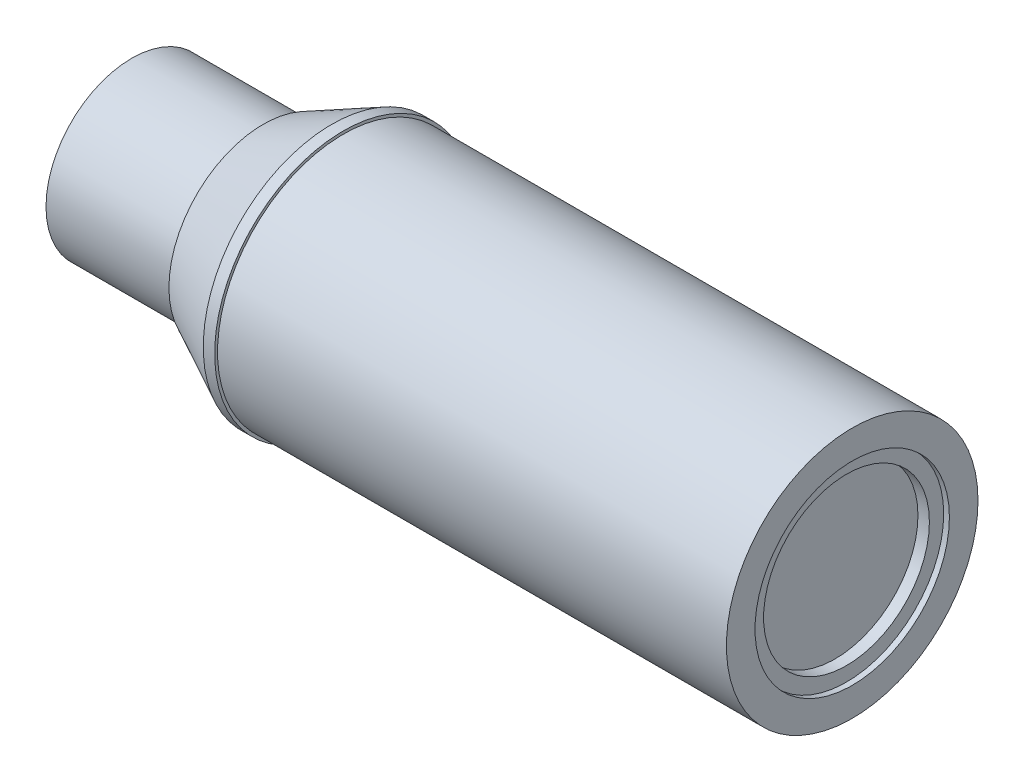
from build123d import *

# Parameters (mm, degrees)
SKETCH1_R           = 15
BOSS_EXTRUDE1_DEPTH = 23
SKETCH3_R           = 16.5
SKETCH4_R           = 22.5
SKETCH5_R           = 22.5
BOSS_EXTRUDE2_DEPTH = 2
SKETCH6_R           = 22
BOSS_EXTRUDE3_DEPTH = 89
SKETCH7_R           = 17
CUT_EXTRUDE1_DEPTH  = 1
SKETCH8_R           = 14.5
CUT_EXTRUDE2_DEPTH  = 2


with BuildPart() as part:
    # Sketch1 → Boss-Extrude1 (new body)
    with BuildSketch(Plane(origin=(0, 0, 0), x_dir=(0, 0, -1), z_dir=(1, 0, 0))):
        Circle(SKETCH1_R)
    extrude(amount=BOSS_EXTRUDE1_DEPTH)

    # Sketch3 → Loft1 section 0
    with BuildSketch(Plane(origin=(23, 0, 0), x_dir=(0, 0, -1), z_dir=(1, 0, 0))):
        Circle(SKETCH3_R)
    # Sketch4 → Loft1 section 1
    with BuildSketch(Plane(origin=(35, 0, 0), x_dir=(0, 0, -1), z_dir=(1, 0, 0))):
        Circle(SKETCH4_R)
    loft()

    # Sketch5 → Boss-Extrude2 (add)
    with BuildSketch(Plane(origin=(35, 0, 0), x_dir=(0, 0, -1), z_dir=(1, 0, 0))):
        Circle(SKETCH5_R)
    extrude(amount=BOSS_EXTRUDE2_DEPTH)

    # Sketch6 → Boss-Extrude3 (add)
    with BuildSketch(Plane(origin=(37, 0, 0), x_dir=(0, 0, -1), z_dir=(1, 0, 0))):
        Circle(SKETCH6_R)
    extrude(amount=BOSS_EXTRUDE3_DEPTH)

    # Sketch7 → Cut-Extrude1 (cut)
    with BuildSketch(Plane(origin=(126, 0, 0), x_dir=(0, 0, -1), z_dir=(1, 0, 0))):
        Circle(SKETCH7_R)
    extrude(amount=-CUT_EXTRUDE1_DEPTH, mode=Mode.SUBTRACT)

    # Sketch8 → Cut-Extrude2 (cut)
    with BuildSketch(Plane(origin=(125, 0, 0), x_dir=(0, 0, -1), z_dir=(1, 0, 0))):
        Circle(SKETCH8_R)
    extrude(amount=-CUT_EXTRUDE2_DEPTH, mode=Mode.SUBTRACT)


solid = part.part
